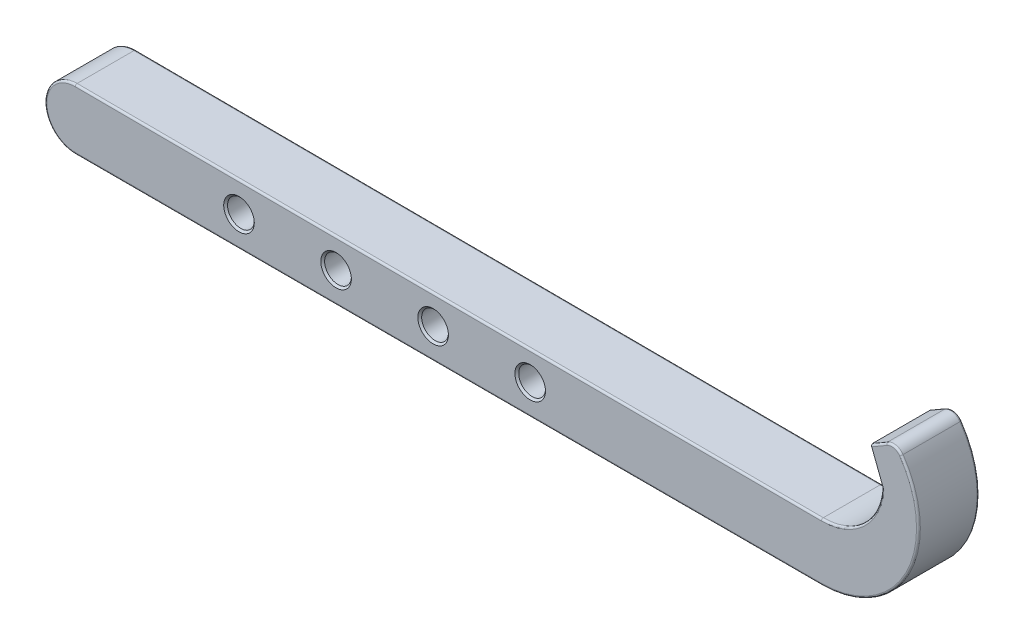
ISO-10303-21;
HEADER;
FILE_DESCRIPTION(('STEP AP214'),'2;1');
FILE_NAME('part.step','',(''),(''),'','','');
FILE_SCHEMA(('AUTOMOTIVE_DESIGN { 1 0 10303 214 1 1 1 1 }'));
ENDSEC;
DATA;
#1=APPLICATION_CONTEXT('core data for automotive mechanical design processes');
#2=APPLICATION_PROTOCOL_DEFINITION('international standard','automotive_design',2000,#1);
#3=PRODUCT_CONTEXT('',#1,'mechanical');
#4=PRODUCT('Part','Part','',(#3));
#5=PRODUCT_RELATED_PRODUCT_CATEGORY('part','',(#4));
#6=PRODUCT_DEFINITION_FORMATION('','',#4);
#7=PRODUCT_DEFINITION_CONTEXT('part definition',#1,'design');
#8=PRODUCT_DEFINITION('design','',#6,#7);
#9=PRODUCT_DEFINITION_SHAPE('','',#8);
#10=(LENGTH_UNIT() NAMED_UNIT(*) SI_UNIT(.MILLI.,.METRE.));
#11=(NAMED_UNIT(*) PLANE_ANGLE_UNIT() SI_UNIT($,.RADIAN.));
#12=(NAMED_UNIT(*) SI_UNIT($,.STERADIAN.) SOLID_ANGLE_UNIT());
#13=UNCERTAINTY_MEASURE_WITH_UNIT(LENGTH_MEASURE(1.E-05),#10,'distance_accuracy_value','');
#14=(GEOMETRIC_REPRESENTATION_CONTEXT(3) GLOBAL_UNCERTAINTY_ASSIGNED_CONTEXT((#13)) GLOBAL_UNIT_ASSIGNED_CONTEXT((#10,
#11,#12)) REPRESENTATION_CONTEXT('',''));
#15=CARTESIAN_POINT('',(0.,0.,0.));
#16=DIRECTION('',(0.,0.,1.));
#17=DIRECTION('',(1.,0.,0.));
#18=AXIS2_PLACEMENT_3D('',#15,#16,#17);
#19=CARTESIAN_POINT('',(-111.669769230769,0.,7.9375));
#20=DIRECTION('',(0.,0.,1.));
#21=DIRECTION('',(1.,0.,0.));
#22=AXIS2_PLACEMENT_3D('',#19,#20,#21);
#23=PLANE('',#22);
#24=DIRECTION('',(0.359521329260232,-0.933136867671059,0.));
#25=VECTOR('',#24,1.);
#26=CARTESIAN_POINT('',(99.4702307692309,23.0323623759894,7.9375));
#27=LINE('',#26,#25);
#28=CARTESIAN_POINT('',(96.7625777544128,30.0600701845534,7.9375));
#29=VERTEX_POINT('',#28);
#30=CARTESIAN_POINT('',(99.9272281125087,21.8462267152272,7.9375));
#31=VERTEX_POINT('',#30);
#32=EDGE_CURVE('E50',#29,#31,#27,.T.);
#33=ORIENTED_EDGE('',*,*,#32,.T.);
#34=CARTESIAN_POINT('',(83.5902307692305,23.0323623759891,7.9375));
#35=DIRECTION('',(0.,0.,1.));
#36=DIRECTION('',(1.,0.,0.));
#37=AXIS2_PLACEMENT_3D('',#34,#35,#36);
#38=CIRCLE('',#37,16.3800000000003);
#39=CARTESIAN_POINT('',(83.5902307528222,6.65235830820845,7.9375));
#40=VERTEX_POINT('',#39);
#41=EDGE_CURVE('E159',#31,#40,#38,.F.);
#42=ORIENTED_EDGE('',*,*,#41,.T.);
#43=DIRECTION('',(-0.999991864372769,0.00403375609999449,0.));
#44=VECTOR('',#43,1.);
#45=CARTESIAN_POINT('',(-111.671786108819,7.44000406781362,7.9375));
#46=LINE('',#45,#44);
#47=CARTESIAN_POINT('',(-111.669769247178,7.43999593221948,7.9375));
#48=VERTEX_POINT('',#47);
#49=EDGE_CURVE('E181',#40,#48,#46,.T.);
#50=ORIENTED_EDGE('',*,*,#49,.T.);
#51=CARTESIAN_POINT('',(-111.669769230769,0.,7.9375));
#52=DIRECTION('',(0.,0.,1.));
#53=DIRECTION('',(1.,0.,0.));
#54=AXIS2_PLACEMENT_3D('',#51,#52,#53);
#55=CIRCLE('',#54,7.44);
#56=CARTESIAN_POINT('',(-111.669769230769,-7.44,7.9375));
#57=VERTEX_POINT('',#56);
#58=EDGE_CURVE('E347',#48,#57,#55,.T.);
#59=ORIENTED_EDGE('',*,*,#58,.T.);
#60=DIRECTION('',(1.,0.,0.));
#61=VECTOR('',#60,1.);
#62=CARTESIAN_POINT('',(83.5902307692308,-7.44,7.9375));
#63=LINE('',#62,#61);
#64=CARTESIAN_POINT('',(83.5902307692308,-7.44,7.9375));
#65=VERTEX_POINT('',#64);
#66=EDGE_CURVE('E349',#57,#65,#63,.T.);
#67=ORIENTED_EDGE('',*,*,#66,.T.);
#68=CARTESIAN_POINT('',(83.5902307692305,17.46,7.9375));
#69=DIRECTION('',(0.,0.,1.));
#70=DIRECTION('',(1.,0.,0.));
#71=AXIS2_PLACEMENT_3D('',#68,#69,#70);
#72=CIRCLE('',#71,24.9000000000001);
#73=CARTESIAN_POINT('',(104.067720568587,31.6262419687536,7.9375));
#74=VERTEX_POINT('',#73);
#75=EDGE_CURVE('E351',#65,#74,#72,.T.);
#76=ORIENTED_EDGE('',*,*,#75,.T.);
#77=CARTESIAN_POINT('',(102.011747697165,30.2039285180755,7.9375));
#78=DIRECTION('',(0.,0.,1.));
#79=DIRECTION('',(1.,0.,0.));
#80=AXIS2_PLACEMENT_3D('',#77,#78,#79);
#81=CIRCLE('',#80,2.50000000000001);
#82=CARTESIAN_POINT('',(100.761747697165,32.3689920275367,7.9375));
#83=VERTEX_POINT('',#82);
#84=EDGE_CURVE('E55',#74,#83,#81,.T.);
#85=ORIENTED_EDGE('',*,*,#84,.T.);
#86=DIRECTION('',(-0.866025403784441,-0.499999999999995,0.));
#87=VECTOR('',#86,1.);
#88=CARTESIAN_POINT('',(96.8306118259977,30.099349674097,7.9375));
#89=LINE('',#88,#87);
#90=EDGE_CURVE('E354',#83,#29,#89,.T.);
#91=ORIENTED_EDGE('',*,*,#90,.T.);
#92=EDGE_LOOP('',(#33,#42,#50,#59,#67,#76,#85,#91));
#93=FACE_BOUND('',#92,.T.);
#94=CARTESIAN_POINT('',(7.39023076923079,0.,7.9375));
#95=DIRECTION('',(0.,0.,1.));
#96=DIRECTION('',(1.,0.,0.));
#97=AXIS2_PLACEMENT_3D('',#94,#95,#96);
#98=CIRCLE('',#97,4.);
#99=CARTESIAN_POINT('',(11.3902307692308,0.,7.9375));
#100=VERTEX_POINT('',#99);
#101=EDGE_CURVE('E178',#100,#100,#98,.F.);
#102=ORIENTED_EDGE('',*,*,#101,.T.);
#103=EDGE_LOOP('',(#102));
#104=FACE_BOUND('',#103,.T.);
#105=CARTESIAN_POINT('',(-18.0097692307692,0.,7.9375));
#106=DIRECTION('',(0.,0.,1.));
#107=DIRECTION('',(1.,0.,0.));
#108=AXIS2_PLACEMENT_3D('',#105,#106,#107);
#109=CIRCLE('',#108,4.);
#110=CARTESIAN_POINT('',(-14.0097692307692,0.,7.9375));
#111=VERTEX_POINT('',#110);
#112=EDGE_CURVE('E293',#111,#111,#109,.F.);
#113=ORIENTED_EDGE('',*,*,#112,.T.);
#114=EDGE_LOOP('',(#113));
#115=FACE_BOUND('',#114,.T.);
#116=CARTESIAN_POINT('',(-43.4097692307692,0.,7.9375));
#117=DIRECTION('',(0.,0.,1.));
#118=DIRECTION('',(1.,0.,0.));
#119=AXIS2_PLACEMENT_3D('',#116,#117,#118);
#120=CIRCLE('',#119,4.00000000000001);
#121=CARTESIAN_POINT('',(-39.4097692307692,0.,7.9375));
#122=VERTEX_POINT('',#121);
#123=EDGE_CURVE('E281',#122,#122,#120,.F.);
#124=ORIENTED_EDGE('',*,*,#123,.T.);
#125=EDGE_LOOP('',(#124));
#126=FACE_BOUND('',#125,.T.);
#127=CARTESIAN_POINT('',(-68.8097692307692,0.,7.9375));
#128=DIRECTION('',(0.,0.,1.));
#129=DIRECTION('',(1.,0.,0.));
#130=AXIS2_PLACEMENT_3D('',#127,#128,#129);
#131=CIRCLE('',#130,4.);
#132=CARTESIAN_POINT('',(-64.8097692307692,0.,7.9375));
#133=VERTEX_POINT('',#132);
#134=EDGE_CURVE('E269',#133,#133,#131,.F.);
#135=ORIENTED_EDGE('',*,*,#134,.T.);
#136=EDGE_LOOP('',(#135));
#137=FACE_BOUND('',#136,.T.);
#138=ADVANCED_FACE('F33',(#93,#104,#115,#126,#137),#23,.T.);
#139=CARTESIAN_POINT('',(-111.669769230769,0.,-7.9375));
#140=DIRECTION('',(0.,0.,1.));
#141=DIRECTION('',(1.,0.,0.));
#142=AXIS2_PLACEMENT_3D('',#139,#140,#141);
#143=PLANE('',#142);
#144=CARTESIAN_POINT('',(7.39023076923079,0.,-7.9375));
#145=DIRECTION('',(0.,0.,1.));
#146=DIRECTION('',(1.,0.,0.));
#147=AXIS2_PLACEMENT_3D('',#144,#145,#146);
#148=CIRCLE('',#147,3.99999999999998);
#149=CARTESIAN_POINT('',(11.3902307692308,0.,-7.9375));
#150=VERTEX_POINT('',#149);
#151=EDGE_CURVE('E296',#150,#150,#148,.T.);
#152=ORIENTED_EDGE('',*,*,#151,.T.);
#153=EDGE_LOOP('',(#152));
#154=FACE_BOUND('',#153,.T.);
#155=CARTESIAN_POINT('',(-18.0097692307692,0.,-7.9375));
#156=DIRECTION('',(0.,0.,1.));
#157=DIRECTION('',(1.,0.,0.));
#158=AXIS2_PLACEMENT_3D('',#155,#156,#157);
#159=CIRCLE('',#158,3.99999999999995);
#160=CARTESIAN_POINT('',(-14.0097692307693,0.,-7.9375));
#161=VERTEX_POINT('',#160);
#162=EDGE_CURVE('E284',#161,#161,#159,.T.);
#163=ORIENTED_EDGE('',*,*,#162,.T.);
#164=EDGE_LOOP('',(#163));
#165=FACE_BOUND('',#164,.T.);
#166=CARTESIAN_POINT('',(-43.4097692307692,0.,-7.9375));
#167=DIRECTION('',(0.,0.,1.));
#168=DIRECTION('',(1.,0.,0.));
#169=AXIS2_PLACEMENT_3D('',#166,#167,#168);
#170=CIRCLE('',#169,3.99999999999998);
#171=CARTESIAN_POINT('',(-39.4097692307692,0.,-7.9375));
#172=VERTEX_POINT('',#171);
#173=EDGE_CURVE('E272',#172,#172,#170,.T.);
#174=ORIENTED_EDGE('',*,*,#173,.T.);
#175=EDGE_LOOP('',(#174));
#176=FACE_BOUND('',#175,.T.);
#177=CARTESIAN_POINT('',(-68.8097692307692,0.,-7.9375));
#178=DIRECTION('',(0.,0.,1.));
#179=DIRECTION('',(1.,0.,0.));
#180=AXIS2_PLACEMENT_3D('',#177,#178,#179);
#181=CIRCLE('',#180,3.99999999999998);
#182=CARTESIAN_POINT('',(-64.8097692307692,0.,-7.9375));
#183=VERTEX_POINT('',#182);
#184=EDGE_CURVE('E260',#183,#183,#181,.T.);
#185=ORIENTED_EDGE('',*,*,#184,.T.);
#186=EDGE_LOOP('',(#185));
#187=FACE_BOUND('',#186,.T.);
#188=CARTESIAN_POINT('',(83.5902307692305,23.0323623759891,-7.9375));
#189=DIRECTION('',(0.,0.,1.));
#190=DIRECTION('',(1.,0.,0.));
#191=AXIS2_PLACEMENT_3D('',#188,#189,#190);
#192=CIRCLE('',#191,16.3800000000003);
#193=CARTESIAN_POINT('',(83.5902307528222,6.65235830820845,-7.9375));
#194=VERTEX_POINT('',#193);
#195=CARTESIAN_POINT('',(99.9272281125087,21.8462267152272,-7.9375));
#196=VERTEX_POINT('',#195);
#197=EDGE_CURVE('E320',#194,#196,#192,.T.);
#198=ORIENTED_EDGE('',*,*,#197,.T.);
#199=DIRECTION('',(0.359521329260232,-0.933136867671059,0.));
#200=VECTOR('',#199,1.);
#201=CARTESIAN_POINT('',(99.4702307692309,23.0323623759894,-7.9375));
#202=LINE('',#201,#200);
#203=CARTESIAN_POINT('',(96.7625777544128,30.0600701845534,-7.9375));
#204=VERTEX_POINT('',#203);
#205=EDGE_CURVE('E232',#204,#196,#202,.T.);
#206=ORIENTED_EDGE('',*,*,#205,.F.);
#207=DIRECTION('',(-0.866025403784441,-0.499999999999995,0.));
#208=VECTOR('',#207,1.);
#209=CARTESIAN_POINT('',(-72.5780746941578,-67.7088010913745,-7.9375));
#210=LINE('',#209,#208);
#211=CARTESIAN_POINT('',(100.761747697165,32.3689920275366,-7.9375));
#212=VERTEX_POINT('',#211);
#213=EDGE_CURVE('E318',#204,#212,#210,.F.);
#214=ORIENTED_EDGE('',*,*,#213,.T.);
#215=CARTESIAN_POINT('',(102.011747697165,30.2039285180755,-7.9375));
#216=DIRECTION('',(0.,0.,1.));
#217=DIRECTION('',(1.,0.,0.));
#218=AXIS2_PLACEMENT_3D('',#215,#216,#217);
#219=CIRCLE('',#218,2.50000000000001);
#220=CARTESIAN_POINT('',(104.067720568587,31.6262419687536,-7.9375));
#221=VERTEX_POINT('',#220);
#222=EDGE_CURVE('E316',#212,#221,#219,.F.);
#223=ORIENTED_EDGE('',*,*,#222,.T.);
#224=CARTESIAN_POINT('',(83.5902307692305,17.46,-7.9375));
#225=DIRECTION('',(0.,0.,1.));
#226=DIRECTION('',(1.,0.,0.));
#227=AXIS2_PLACEMENT_3D('',#224,#225,#226);
#228=CIRCLE('',#227,24.9000000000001);
#229=CARTESIAN_POINT('',(83.5902307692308,-7.44,-7.9375));
#230=VERTEX_POINT('',#229);
#231=EDGE_CURVE('E314',#221,#230,#228,.F.);
#232=ORIENTED_EDGE('',*,*,#231,.T.);
#233=DIRECTION('',(1.,0.,0.));
#234=VECTOR('',#233,1.);
#235=CARTESIAN_POINT('',(-111.669769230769,-7.44,-7.9375));
#236=LINE('',#235,#234);
#237=CARTESIAN_POINT('',(-111.669769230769,-7.44,-7.9375));
#238=VERTEX_POINT('',#237);
#239=EDGE_CURVE('E312',#230,#238,#236,.F.);
#240=ORIENTED_EDGE('',*,*,#239,.T.);
#241=CARTESIAN_POINT('',(-111.669769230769,0.,-7.9375));
#242=DIRECTION('',(0.,0.,1.));
#243=DIRECTION('',(1.,0.,0.));
#244=AXIS2_PLACEMENT_3D('',#241,#242,#243);
#245=CIRCLE('',#244,7.44);
#246=CARTESIAN_POINT('',(-111.669769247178,7.43999593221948,-7.9375));
#247=VERTEX_POINT('',#246);
#248=EDGE_CURVE('E310',#238,#247,#245,.F.);
#249=ORIENTED_EDGE('',*,*,#248,.T.);
#250=DIRECTION('',(-0.999991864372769,0.00403375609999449,0.));
#251=VECTOR('',#250,1.);
#252=CARTESIAN_POINT('',(-111.639758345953,7.43987487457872,-7.9375));
#253=LINE('',#252,#251);
#254=EDGE_CURVE('E308',#247,#194,#253,.F.);
#255=ORIENTED_EDGE('',*,*,#254,.T.);
#256=EDGE_LOOP('',(#198,#206,#214,#223,#232,#240,#249,#255));
#257=FACE_BOUND('',#256,.T.);
#258=ADVANCED_FACE('F415',(#154,#165,#176,#187,#257),#143,.F.);
#259=CARTESIAN_POINT('',(-111.669769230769,0.,7.9375));
#260=DIRECTION('',(0.,0.,-1.));
#261=DIRECTION('',(-1.,0.,0.));
#262=AXIS2_PLACEMENT_3D('',#259,#260,#261);
#263=CYLINDRICAL_SURFACE('',#262,7.94);
#264=DIRECTION('',(0.,0.,-1.));
#265=VECTOR('',#264,1.);
#266=CARTESIAN_POINT('',(-111.669769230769,7.94,7.9375));
#267=LINE('',#266,#265);
#268=CARTESIAN_POINT('',(-111.669769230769,7.94,7.4375));
#269=VERTEX_POINT('',#268);
#270=CARTESIAN_POINT('',(-111.669769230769,7.94,-7.4375));
#271=VERTEX_POINT('',#270);
#272=EDGE_CURVE('E153',#269,#271,#267,.T.);
#273=ORIENTED_EDGE('',*,*,#272,.T.);
#274=CARTESIAN_POINT('',(-111.669769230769,0.,-7.4375));
#275=DIRECTION('',(0.,0.,1.));
#276=DIRECTION('',(1.,0.,0.));
#277=AXIS2_PLACEMENT_3D('',#274,#275,#276);
#278=CIRCLE('',#277,7.94);
#279=CARTESIAN_POINT('',(-111.669769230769,-7.94,-7.4375));
#280=VERTEX_POINT('',#279);
#281=EDGE_CURVE('E344',#271,#280,#278,.T.);
#282=ORIENTED_EDGE('',*,*,#281,.T.);
#283=DIRECTION('',(0.,0.,-1.));
#284=VECTOR('',#283,1.);
#285=CARTESIAN_POINT('',(-111.669769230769,-7.94,7.9375));
#286=LINE('',#285,#284);
#287=CARTESIAN_POINT('',(-111.669769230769,-7.94,7.4375));
#288=VERTEX_POINT('',#287);
#289=EDGE_CURVE('E257',#288,#280,#286,.T.);
#290=ORIENTED_EDGE('',*,*,#289,.F.);
#291=CARTESIAN_POINT('',(-111.669769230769,0.,7.4375));
#292=DIRECTION('',(0.,0.,1.));
#293=DIRECTION('',(1.,0.,0.));
#294=AXIS2_PLACEMENT_3D('',#291,#292,#293);
#295=CIRCLE('',#294,7.94);
#296=EDGE_CURVE('E342',#288,#269,#295,.F.);
#297=ORIENTED_EDGE('',*,*,#296,.T.);
#298=EDGE_LOOP('',(#273,#282,#290,#297));
#299=FACE_BOUND('',#298,.T.);
#300=ADVANCED_FACE('F420',(#299),#263,.T.);
#301=CARTESIAN_POINT('',(-111.669769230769,-7.94,7.9375));
#302=DIRECTION('',(0.,1.,0.));
#303=DIRECTION('',(0.,0.,1.));
#304=AXIS2_PLACEMENT_3D('',#301,#302,#303);
#305=PLANE('',#304);
#306=ORIENTED_EDGE('',*,*,#289,.T.);
#307=DIRECTION('',(1.,0.,0.));
#308=VECTOR('',#307,1.);
#309=CARTESIAN_POINT('',(-111.669769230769,-7.94,-7.4375));
#310=LINE('',#309,#308);
#311=CARTESIAN_POINT('',(83.5902307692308,-7.94000000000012,-7.4375));
#312=VERTEX_POINT('',#311);
#313=EDGE_CURVE('E340',#280,#312,#310,.T.);
#314=ORIENTED_EDGE('',*,*,#313,.T.);
#315=DIRECTION('',(0.,0.,-1.));
#316=VECTOR('',#315,1.);
#317=CARTESIAN_POINT('',(83.5902307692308,-7.94000000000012,7.9375));
#318=LINE('',#317,#316);
#319=CARTESIAN_POINT('',(83.5902307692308,-7.94000000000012,7.4375));
#320=VERTEX_POINT('',#319);
#321=EDGE_CURVE('E254',#320,#312,#318,.T.);
#322=ORIENTED_EDGE('',*,*,#321,.F.);
#323=DIRECTION('',(1.,0.,0.));
#324=VECTOR('',#323,1.);
#325=CARTESIAN_POINT('',(-111.669769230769,-7.94,7.4375));
#326=LINE('',#325,#324);
#327=EDGE_CURVE('E338',#320,#288,#326,.F.);
#328=ORIENTED_EDGE('',*,*,#327,.T.);
#329=EDGE_LOOP('',(#306,#314,#322,#328));
#330=FACE_BOUND('',#329,.T.);
#331=ADVANCED_FACE('F459',(#330),#305,.F.);
#332=CARTESIAN_POINT('',(83.5902307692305,17.46,7.9375));
#333=DIRECTION('',(0.,0.,-1.));
#334=DIRECTION('',(-1.,0.,0.));
#335=AXIS2_PLACEMENT_3D('',#332,#333,#334);
#336=CYLINDRICAL_SURFACE('',#335,25.4000000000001);
#337=ORIENTED_EDGE('',*,*,#321,.T.);
#338=CARTESIAN_POINT('',(83.5902307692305,17.46,-7.4375));
#339=DIRECTION('',(0.,0.,1.));
#340=DIRECTION('',(1.,0.,0.));
#341=AXIS2_PLACEMENT_3D('',#338,#339,#340);
#342=CIRCLE('',#341,25.4000000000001);
#343=CARTESIAN_POINT('',(104.478915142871,31.9107046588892,-7.4375));
#344=VERTEX_POINT('',#343);
#345=EDGE_CURVE('E336',#312,#344,#342,.T.);
#346=ORIENTED_EDGE('',*,*,#345,.T.);
#347=DIRECTION('',(0.,0.,-1.));
#348=VECTOR('',#347,1.);
#349=CARTESIAN_POINT('',(104.478915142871,31.9107046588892,7.9375));
#350=LINE('',#349,#348);
#351=CARTESIAN_POINT('',(104.478915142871,31.9107046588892,7.4375));
#352=VERTEX_POINT('',#351);
#353=EDGE_CURVE('E251',#352,#344,#350,.T.);
#354=ORIENTED_EDGE('',*,*,#353,.F.);
#355=CARTESIAN_POINT('',(83.5902307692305,17.46,7.4375));
#356=DIRECTION('',(0.,0.,1.));
#357=DIRECTION('',(1.,0.,0.));
#358=AXIS2_PLACEMENT_3D('',#355,#356,#357);
#359=CIRCLE('',#358,25.4000000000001);
#360=EDGE_CURVE('E334',#352,#320,#359,.F.);
#361=ORIENTED_EDGE('',*,*,#360,.T.);
#362=EDGE_LOOP('',(#337,#346,#354,#361));
#363=FACE_BOUND('',#362,.T.);
#364=ADVANCED_FACE('F457',(#363),#336,.T.);
#365=CARTESIAN_POINT('',(102.011747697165,30.2039285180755,7.9375));
#366=DIRECTION('',(0.,0.,-1.));
#367=DIRECTION('',(-1.,0.,0.));
#368=AXIS2_PLACEMENT_3D('',#365,#366,#367);
#369=CYLINDRICAL_SURFACE('',#368,3.00000000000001);
#370=ORIENTED_EDGE('',*,*,#353,.T.);
#371=CARTESIAN_POINT('',(102.011747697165,30.2039285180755,-7.4375));
#372=DIRECTION('',(0.,0.,1.));
#373=DIRECTION('',(1.,0.,0.));
#374=AXIS2_PLACEMENT_3D('',#371,#372,#373);
#375=CIRCLE('',#374,3.00000000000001);
#376=CARTESIAN_POINT('',(100.511747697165,32.8020047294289,-7.4375));
#377=VERTEX_POINT('',#376);
#378=EDGE_CURVE('E332',#344,#377,#375,.T.);
#379=ORIENTED_EDGE('',*,*,#378,.T.);
#380=DIRECTION('',(0.,0.,-1.));
#381=VECTOR('',#380,1.);
#382=CARTESIAN_POINT('',(100.511747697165,32.8020047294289,7.9375));
#383=LINE('',#382,#381);
#384=CARTESIAN_POINT('',(100.511747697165,32.8020047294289,7.4375));
#385=VERTEX_POINT('',#384);
#386=EDGE_CURVE('E248',#385,#377,#383,.T.);
#387=ORIENTED_EDGE('',*,*,#386,.F.);
#388=CARTESIAN_POINT('',(102.011747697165,30.2039285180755,7.4375));
#389=DIRECTION('',(0.,0.,1.));
#390=DIRECTION('',(1.,0.,0.));
#391=AXIS2_PLACEMENT_3D('',#388,#389,#390);
#392=CIRCLE('',#391,3.00000000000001);
#393=EDGE_CURVE('E330',#385,#352,#392,.F.);
#394=ORIENTED_EDGE('',*,*,#393,.T.);
#395=EDGE_LOOP('',(#370,#379,#387,#394));
#396=FACE_BOUND('',#395,.T.);
#397=ADVANCED_FACE('F437',(#396),#369,.T.);
#398=CARTESIAN_POINT('',(96.5806118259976,30.5323623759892,7.9375));
#399=DIRECTION('',(0.499999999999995,-0.866025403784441,0.));
#400=DIRECTION('',(0.866025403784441,0.499999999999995,0.));
#401=AXIS2_PLACEMENT_3D('',#398,#399,#400);
#402=PLANE('',#401);
#403=ORIENTED_EDGE('',*,*,#386,.T.);
#404=DIRECTION('',(-0.866025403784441,-0.499999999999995,0.));
#405=VECTOR('',#404,1.);
#406=CARTESIAN_POINT('',(96.5806118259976,30.5323623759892,-7.4375));
#407=LINE('',#406,#405);
#408=CARTESIAN_POINT('',(96.5806118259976,30.5323623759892,-7.4375));
#409=VERTEX_POINT('',#408);
#410=EDGE_CURVE('E324',#377,#409,#407,.T.);
#411=ORIENTED_EDGE('',*,*,#410,.T.);
#412=DIRECTION('',(0.,0.,-1.));
#413=VECTOR('',#412,1.);
#414=CARTESIAN_POINT('',(96.5806118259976,30.5323623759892,7.9375));
#415=LINE('',#414,#413);
#416=CARTESIAN_POINT('',(96.5806118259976,30.5323623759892,7.4375));
#417=VERTEX_POINT('',#416);
#418=EDGE_CURVE('E245',#417,#409,#415,.T.);
#419=ORIENTED_EDGE('',*,*,#418,.F.);
#420=DIRECTION('',(-0.866025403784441,-0.499999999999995,0.));
#421=VECTOR('',#420,1.);
#422=CARTESIAN_POINT('',(100.511747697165,32.8020047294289,7.4375));
#423=LINE('',#422,#421);
#424=EDGE_CURVE('E322',#417,#385,#423,.F.);
#425=ORIENTED_EDGE('',*,*,#424,.T.);
#426=EDGE_LOOP('',(#403,#411,#419,#425));
#427=FACE_BOUND('',#426,.T.);
#428=ADVANCED_FACE('F433',(#427),#402,.F.);
#429=CARTESIAN_POINT('',(99.4702307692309,23.0323623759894,7.9375));
#430=DIRECTION('',(0.933136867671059,0.359521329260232,0.));
#431=DIRECTION('',(-0.359521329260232,0.933136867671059,0.));
#432=AXIS2_PLACEMENT_3D('',#429,#430,#431);
#433=PLANE('',#432);
#434=ORIENTED_EDGE('',*,*,#418,.T.);
#435=CARTESIAN_POINT('',(96.7625777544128,30.0600701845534,-7.4375));
#436=DIRECTION('',(0.933136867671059,0.359521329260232,0.));
#437=DIRECTION('',(0.359521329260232,-0.933136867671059,0.));
#438=AXIS2_PLACEMENT_3D('',#435,#436,#437);
#439=ELLIPSE('',#438,0.506133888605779,0.5);
#440=EDGE_CURVE('E328',#409,#204,#439,.F.);
#441=ORIENTED_EDGE('',*,*,#440,.T.);
#442=ORIENTED_EDGE('',*,*,#205,.T.);
#443=CARTESIAN_POINT('',(99.9272281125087,21.8462267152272,-7.9375));
#444=CARTESIAN_POINT('',(99.913140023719,21.8827923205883,-7.93749370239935));
#445=CARTESIAN_POINT('',(99.8990526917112,21.9193559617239,-7.93666341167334));
#446=CARTESIAN_POINT('',(99.8709003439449,21.9924253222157,-7.93337699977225));
#447=CARTESIAN_POINT('',(99.8568353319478,22.0289310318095,-7.9309206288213));
#448=CARTESIAN_POINT('',(99.8286299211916,22.1021381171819,-7.92437572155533));
#449=CARTESIAN_POINT('',(99.8144899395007,22.1388384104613,-7.92027309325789));
#450=CARTESIAN_POINT('',(99.7862884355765,22.2120353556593,-7.91040466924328));
#451=CARTESIAN_POINT('',(99.7722269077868,22.2485320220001,-7.90463899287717));
#452=CARTESIAN_POINT('',(99.7302434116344,22.3575000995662,-7.88479019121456));
#453=CARTESIAN_POINT('',(99.7024635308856,22.4296027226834,-7.86814204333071));
#454=CARTESIAN_POINT('',(99.6614523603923,22.5360471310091,-7.83703491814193));
#455=CARTESIAN_POINT('',(99.6479128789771,22.5711888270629,-7.82566645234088));
#456=CARTESIAN_POINT('',(99.6211284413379,22.6407077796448,-7.80052070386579));
#457=CARTESIAN_POINT('',(99.6078832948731,22.6750855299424,-7.7867450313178));
#458=CARTESIAN_POINT('',(99.5859528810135,22.7320058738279,-7.76103294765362));
#459=CARTESIAN_POINT('',(99.5771479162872,22.7548591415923,-7.74988842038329));
#460=CARTESIAN_POINT('',(99.5597877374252,22.7999174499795,-7.72583440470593));
#461=CARTESIAN_POINT('',(99.551234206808,22.822118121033,-7.71291534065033));
#462=CARTESIAN_POINT('',(99.5325589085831,22.8705898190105,-7.68155320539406));
#463=CARTESIAN_POINT('',(99.5225615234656,22.8965380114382,-7.66253077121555));
#464=CARTESIAN_POINT('',(99.5039023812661,22.9449677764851,-7.61994650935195));
#465=CARTESIAN_POINT('',(99.4952299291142,22.9674771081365,-7.59642491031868));
#466=CARTESIAN_POINT('',(99.4852729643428,22.9933203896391,-7.55983401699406));
#467=CARTESIAN_POINT('',(99.4827552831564,22.9998550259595,-7.54940156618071));
#468=CARTESIAN_POINT('',(99.4782899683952,23.0114447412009,-7.52766696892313));
#469=CARTESIAN_POINT('',(99.4763399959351,23.0165058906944,-7.51636864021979));
#470=CARTESIAN_POINT('',(99.4733200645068,23.0243441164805,-7.49402574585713));
#471=CARTESIAN_POINT('',(99.4721869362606,23.0272851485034,-7.48304906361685));
#472=CARTESIAN_POINT('',(99.4706308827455,23.0313238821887,-7.46056800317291));
#473=CARTESIAN_POINT('',(99.4702176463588,23.032396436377,-7.44905853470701));
#474=CARTESIAN_POINT('',(99.4702307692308,23.0323623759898,-7.43750000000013));
#475=B_SPLINE_CURVE_WITH_KNOTS('',3,(#443,#444,#445,#446,#447,#448,#449,#450,#451,#452,#453,
#454,#455,#456,#457,#458,#459,#460,#461,#462,#463,#464,#465,#466,#467,#468,#469,#470,#471,#472,
#473,#474),.UNSPECIFIED.,.F.,.F.,(4,2,2,2,2,2,2,2,2,2,2,2,2,2,2,4),(0.,0.117544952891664,
0.235107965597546,0.353699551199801,0.472282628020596,0.708956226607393,0.826916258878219,
0.944797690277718,1.02547141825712,1.10659895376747,1.20745259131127,1.3074433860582,
1.34503815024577,1.38247576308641,1.41656074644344,1.45110102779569),.UNSPECIFIED.);
#476=CARTESIAN_POINT('',(99.4702307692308,23.0323623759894,-7.4375));
#477=VERTEX_POINT('',#476);
#478=EDGE_CURVE('E42',#196,#477,#475,.T.);
#479=ORIENTED_EDGE('',*,*,#478,.T.);
#480=DIRECTION('',(0.,0.,-1.));
#481=VECTOR('',#480,1.);
#482=CARTESIAN_POINT('',(99.4702307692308,23.0323623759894,7.9375));
#483=LINE('',#482,#481);
#484=CARTESIAN_POINT('',(99.4702307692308,23.0323623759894,7.4375));
#485=VERTEX_POINT('',#484);
#486=EDGE_CURVE('E170',#485,#477,#483,.T.);
#487=ORIENTED_EDGE('',*,*,#486,.F.);
#488=CARTESIAN_POINT('',(99.4702307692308,23.0323623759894,7.4375));
#489=CARTESIAN_POINT('',(99.4702180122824,23.0323954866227,7.44902944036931));
#490=CARTESIAN_POINT('',(99.470628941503,23.0313289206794,7.46050905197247));
#491=CARTESIAN_POINT('',(99.4721768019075,23.0273114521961,7.48293211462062));
#492=CARTESIAN_POINT('',(99.4733039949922,23.0243858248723,7.49388066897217));
#493=CARTESIAN_POINT('',(99.4765415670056,23.0159827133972,7.51789290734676));
#494=CARTESIAN_POINT('',(99.4788315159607,23.010039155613,7.53076513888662));
#495=CARTESIAN_POINT('',(99.4841214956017,22.996309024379,7.55537911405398));
#496=CARTESIAN_POINT('',(99.4871254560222,22.9885122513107,7.56711407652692));
#497=CARTESIAN_POINT('',(99.4959502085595,22.9656076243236,7.59745581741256));
#498=CARTESIAN_POINT('',(99.50224879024,22.9492596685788,7.61497308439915));
#499=CARTESIAN_POINT('',(99.5156486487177,22.9144803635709,7.64738411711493));
#500=CARTESIAN_POINT('',(99.522751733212,22.8960443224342,7.66227177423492));
#501=CARTESIAN_POINT('',(99.5400728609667,22.8510873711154,7.69497139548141));
#502=CARTESIAN_POINT('',(99.5504972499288,22.8240308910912,7.71192829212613));
#503=CARTESIAN_POINT('',(99.5718720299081,22.7685526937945,7.74309058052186));
#504=CARTESIAN_POINT('',(99.5828233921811,22.74012845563,7.75729062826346));
#505=CARTESIAN_POINT('',(99.6051480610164,22.6821848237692,7.78360611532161));
#506=CARTESIAN_POINT('',(99.6165240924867,22.6526583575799,7.79570349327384));
#507=CARTESIAN_POINT('',(99.6394960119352,22.593034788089,7.81804028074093));
#508=CARTESIAN_POINT('',(99.6510917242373,22.5629381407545,7.8282811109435));
#509=CARTESIAN_POINT('',(99.6846043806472,22.4759561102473,7.855394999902));
#510=CARTESIAN_POINT('',(99.7067289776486,22.4185317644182,7.8702924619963));
#511=CARTESIAN_POINT('',(99.7513305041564,22.302768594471,7.89547628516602));
#512=CARTESIAN_POINT('',(99.7738078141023,22.2444287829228,7.90575725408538));
#513=CARTESIAN_POINT('',(99.8180949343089,22.1294816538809,7.9217599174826));
#514=CARTESIAN_POINT('',(99.8398973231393,22.0728935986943,7.92764120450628));
#515=CARTESIAN_POINT('',(99.8835427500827,21.959611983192,7.93548727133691));
#516=CARTESIAN_POINT('',(99.9053855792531,21.9029189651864,7.93746103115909));
#517=CARTESIAN_POINT('',(99.9272281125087,21.8462267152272,7.9375));
#518=B_SPLINE_CURVE_WITH_KNOTS('',3,(#488,#489,#490,#491,#492,#493,#494,#495,#496,#497,#498,
#499,#500,#501,#502,#503,#504,#505,#506,#507,#508,#509,#510,#511,#512,#513,#514,#515,#516,#517),
.UNSPECIFIED.,.F.,.F.,(4,2,2,2,2,2,2,2,2,2,2,2,2,2,4),(0.,0.034451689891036,0.0684447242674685,
0.111287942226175,0.154372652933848,0.228278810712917,0.302354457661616,0.40289075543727,
0.503620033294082,0.605175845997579,0.706653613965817,0.896365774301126,1.08629894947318,
1.26895499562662,1.45119078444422),.UNSPECIFIED.);
#519=EDGE_CURVE('E11',#485,#31,#518,.T.);
#520=ORIENTED_EDGE('',*,*,#519,.T.);
#521=ORIENTED_EDGE('',*,*,#32,.F.);
#522=CARTESIAN_POINT('',(96.7625777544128,30.0600701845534,7.4375));
#523=DIRECTION('',(0.933136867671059,0.359521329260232,0.));
#524=DIRECTION('',(-0.359521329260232,0.933136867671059,0.));
#525=AXIS2_PLACEMENT_3D('',#522,#523,#524);
#526=ELLIPSE('',#525,0.506133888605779,0.5);
#527=EDGE_CURVE('E326',#29,#417,#526,.F.);
#528=ORIENTED_EDGE('',*,*,#527,.T.);
#529=EDGE_LOOP('',(#434,#441,#442,#479,#487,#520,#521,#528));
#530=FACE_BOUND('',#529,.T.);
#531=ADVANCED_FACE('F361',(#530),#433,.F.);
#532=CARTESIAN_POINT('',(83.5902307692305,23.0323623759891,7.9375));
#533=DIRECTION('',(0.,0.,-1.));
#534=DIRECTION('',(-1.,0.,0.));
#535=AXIS2_PLACEMENT_3D('',#532,#533,#534);
#536=CYLINDRICAL_SURFACE('',#535,15.8800000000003);
#537=ORIENTED_EDGE('',*,*,#486,.T.);
#538=CARTESIAN_POINT('',(83.5902307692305,23.0323623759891,-7.4375));
#539=DIRECTION('',(0.,0.,1.));
#540=DIRECTION('',(1.,0.,0.));
#541=AXIS2_PLACEMENT_3D('',#538,#539,#540);
#542=CIRCLE('',#541,15.8800000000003);
#543=CARTESIAN_POINT('',(83.5902307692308,7.15236237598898,-7.4375));
#544=VERTEX_POINT('',#543);
#545=EDGE_CURVE('E169',#477,#544,#542,.F.);
#546=ORIENTED_EDGE('',*,*,#545,.T.);
#547=DIRECTION('',(0.,0.,-1.));
#548=VECTOR('',#547,1.);
#549=CARTESIAN_POINT('',(83.5902307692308,7.15236237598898,7.9375));
#550=LINE('',#549,#548);
#551=CARTESIAN_POINT('',(83.5902307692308,7.15236237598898,7.4375));
#552=VERTEX_POINT('',#551);
#553=EDGE_CURVE('E151',#552,#544,#550,.T.);
#554=ORIENTED_EDGE('',*,*,#553,.F.);
#555=CARTESIAN_POINT('',(83.5902307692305,23.0323623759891,7.4375));
#556=DIRECTION('',(0.,0.,1.));
#557=DIRECTION('',(1.,0.,0.));
#558=AXIS2_PLACEMENT_3D('',#555,#556,#557);
#559=CIRCLE('',#558,15.8800000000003);
#560=EDGE_CURVE('E166',#552,#485,#559,.T.);
#561=ORIENTED_EDGE('',*,*,#560,.T.);
#562=EDGE_LOOP('',(#537,#546,#554,#561));
#563=FACE_BOUND('',#562,.T.);
#564=ADVANCED_FACE('F165',(#563),#536,.F.);
#565=CARTESIAN_POINT('',(-111.669769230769,7.94,7.9375));
#566=DIRECTION('',(-0.00403375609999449,-0.999991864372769,0.));
#567=DIRECTION('',(0.999991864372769,-0.00403375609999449,0.));
#568=AXIS2_PLACEMENT_3D('',#565,#566,#567);
#569=PLANE('',#568);
#570=ORIENTED_EDGE('',*,*,#553,.T.);
#571=DIRECTION('',(-0.999991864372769,0.00403375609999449,0.));
#572=VECTOR('',#571,1.);
#573=CARTESIAN_POINT('',(-111.669769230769,7.94,-7.4375));
#574=LINE('',#573,#572);
#575=EDGE_CURVE('E158',#544,#271,#574,.T.);
#576=ORIENTED_EDGE('',*,*,#575,.T.);
#577=ORIENTED_EDGE('',*,*,#272,.F.);
#578=DIRECTION('',(-0.999991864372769,0.00403375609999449,0.));
#579=VECTOR('',#578,1.);
#580=CARTESIAN_POINT('',(83.5902307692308,7.15236237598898,7.4375));
#581=LINE('',#580,#579);
#582=EDGE_CURVE('E148',#269,#552,#581,.F.);
#583=ORIENTED_EDGE('',*,*,#582,.T.);
#584=EDGE_LOOP('',(#570,#576,#577,#583));
#585=FACE_BOUND('',#584,.T.);
#586=ADVANCED_FACE('F150',(#585),#569,.F.);
#587=CARTESIAN_POINT('',(-68.8097692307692,0.,7.9375));
#588=DIRECTION('',(0.,0.,-1.));
#589=DIRECTION('',(-1.,0.,0.));
#590=AXIS2_PLACEMENT_3D('',#587,#588,#589);
#591=CYLINDRICAL_SURFACE('',#590,3.50000000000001);
#592=CARTESIAN_POINT('',(-68.8097692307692,0.,-7.43750000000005));
#593=DIRECTION('',(0.,0.,1.));
#594=DIRECTION('',(1.,0.,0.));
#595=AXIS2_PLACEMENT_3D('',#592,#593,#594);
#596=CIRCLE('',#595,3.50000000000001);
#597=CARTESIAN_POINT('',(-65.3097692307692,0.,-7.43750000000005));
#598=VERTEX_POINT('',#597);
#599=EDGE_CURVE('E266',#598,#598,#596,.F.);
#600=ORIENTED_EDGE('',*,*,#599,.T.);
#601=EDGE_LOOP('',(#600));
#602=FACE_BOUND('',#601,.T.);
#603=CARTESIAN_POINT('',(-68.8097692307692,0.,7.43749999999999));
#604=DIRECTION('',(0.,0.,1.));
#605=DIRECTION('',(1.,0.,0.));
#606=AXIS2_PLACEMENT_3D('',#603,#604,#605);
#607=CIRCLE('',#606,3.50000000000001);
#608=CARTESIAN_POINT('',(-65.3097692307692,0.,7.43749999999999));
#609=VERTEX_POINT('',#608);
#610=EDGE_CURVE('E263',#609,#609,#607,.T.);
#611=ORIENTED_EDGE('',*,*,#610,.T.);
#612=EDGE_LOOP('',(#611));
#613=FACE_BOUND('',#612,.T.);
#614=ADVANCED_FACE('F425',(#602,#613),#591,.F.);
#615=CARTESIAN_POINT('',(-43.4097692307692,0.,7.9375));
#616=DIRECTION('',(0.,0.,-1.));
#617=DIRECTION('',(-1.,0.,0.));
#618=AXIS2_PLACEMENT_3D('',#615,#616,#617);
#619=CYLINDRICAL_SURFACE('',#618,3.50000000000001);
#620=CARTESIAN_POINT('',(-43.4097692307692,0.,-7.43750000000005));
#621=DIRECTION('',(0.,0.,1.));
#622=DIRECTION('',(1.,0.,0.));
#623=AXIS2_PLACEMENT_3D('',#620,#621,#622);
#624=CIRCLE('',#623,3.50000000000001);
#625=CARTESIAN_POINT('',(-39.9097692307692,0.,-7.43750000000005));
#626=VERTEX_POINT('',#625);
#627=EDGE_CURVE('E278',#626,#626,#624,.F.);
#628=ORIENTED_EDGE('',*,*,#627,.T.);
#629=EDGE_LOOP('',(#628));
#630=FACE_BOUND('',#629,.T.);
#631=CARTESIAN_POINT('',(-43.4097692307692,0.,7.43749999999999));
#632=DIRECTION('',(0.,0.,1.));
#633=DIRECTION('',(1.,0.,0.));
#634=AXIS2_PLACEMENT_3D('',#631,#632,#633);
#635=CIRCLE('',#634,3.50000000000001);
#636=CARTESIAN_POINT('',(-39.9097692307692,0.,7.43749999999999));
#637=VERTEX_POINT('',#636);
#638=EDGE_CURVE('E275',#637,#637,#635,.T.);
#639=ORIENTED_EDGE('',*,*,#638,.T.);
#640=EDGE_LOOP('',(#639));
#641=FACE_BOUND('',#640,.T.);
#642=ADVANCED_FACE('F535',(#630,#641),#619,.F.);
#643=CARTESIAN_POINT('',(-18.0097692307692,0.,7.9375));
#644=DIRECTION('',(0.,0.,-1.));
#645=DIRECTION('',(-1.,0.,0.));
#646=AXIS2_PLACEMENT_3D('',#643,#644,#645);
#647=CYLINDRICAL_SURFACE('',#646,3.50000000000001);
#648=CARTESIAN_POINT('',(-18.0097692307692,0.,-7.43750000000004));
#649=DIRECTION('',(0.,0.,1.));
#650=DIRECTION('',(1.,0.,0.));
#651=AXIS2_PLACEMENT_3D('',#648,#649,#650);
#652=CIRCLE('',#651,3.50000000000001);
#653=CARTESIAN_POINT('',(-14.5097692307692,0.,-7.43750000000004));
#654=VERTEX_POINT('',#653);
#655=EDGE_CURVE('E290',#654,#654,#652,.F.);
#656=ORIENTED_EDGE('',*,*,#655,.T.);
#657=EDGE_LOOP('',(#656));
#658=FACE_BOUND('',#657,.T.);
#659=CARTESIAN_POINT('',(-18.0097692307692,0.,7.43749999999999));
#660=DIRECTION('',(0.,0.,1.));
#661=DIRECTION('',(1.,0.,0.));
#662=AXIS2_PLACEMENT_3D('',#659,#660,#661);
#663=CIRCLE('',#662,3.50000000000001);
#664=CARTESIAN_POINT('',(-14.5097692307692,0.,7.43749999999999));
#665=VERTEX_POINT('',#664);
#666=EDGE_CURVE('E287',#665,#665,#663,.T.);
#667=ORIENTED_EDGE('',*,*,#666,.T.);
#668=EDGE_LOOP('',(#667));
#669=FACE_BOUND('',#668,.T.);
#670=ADVANCED_FACE('F528',(#658,#669),#647,.F.);
#671=CARTESIAN_POINT('',(7.39023076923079,0.,7.9375));
#672=DIRECTION('',(0.,0.,-1.));
#673=DIRECTION('',(-1.,0.,0.));
#674=AXIS2_PLACEMENT_3D('',#671,#672,#673);
#675=CYLINDRICAL_SURFACE('',#674,3.50000000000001);
#676=CARTESIAN_POINT('',(7.39023076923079,0.,-7.43750000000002));
#677=DIRECTION('',(0.,0.,1.));
#678=DIRECTION('',(1.,0.,0.));
#679=AXIS2_PLACEMENT_3D('',#676,#677,#678);
#680=CIRCLE('',#679,3.50000000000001);
#681=CARTESIAN_POINT('',(10.8902307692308,0.,-7.43750000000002));
#682=VERTEX_POINT('',#681);
#683=EDGE_CURVE('E302',#682,#682,#680,.F.);
#684=ORIENTED_EDGE('',*,*,#683,.T.);
#685=EDGE_LOOP('',(#684));
#686=FACE_BOUND('',#685,.T.);
#687=CARTESIAN_POINT('',(7.39023076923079,0.,7.43749999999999));
#688=DIRECTION('',(0.,0.,1.));
#689=DIRECTION('',(1.,0.,0.));
#690=AXIS2_PLACEMENT_3D('',#687,#688,#689);
#691=CIRCLE('',#690,3.50000000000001);
#692=CARTESIAN_POINT('',(10.8902307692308,0.,7.43749999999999));
#693=VERTEX_POINT('',#692);
#694=EDGE_CURVE('E299',#693,#693,#691,.T.);
#695=ORIENTED_EDGE('',*,*,#694,.T.);
#696=EDGE_LOOP('',(#695));
#697=FACE_BOUND('',#696,.T.);
#698=ADVANCED_FACE('F486',(#686,#697),#675,.F.);
#699=CARTESIAN_POINT('',(-68.8097692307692,0.,-7.9375));
#700=DIRECTION('',(0.,0.,-1.));
#701=DIRECTION('',(-1.,0.,0.));
#702=AXIS2_PLACEMENT_3D('',#699,#700,#701);
#703=CONICAL_SURFACE('',#702,3.99999999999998,0.785398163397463);
#704=ORIENTED_EDGE('',*,*,#599,.F.);
#705=EDGE_LOOP('',(#704));
#706=FACE_BOUND('',#705,.T.);
#707=ORIENTED_EDGE('',*,*,#184,.F.);
#708=EDGE_LOOP('',(#707));
#709=FACE_BOUND('',#708,.T.);
#710=ADVANCED_FACE('F482',(#706,#709),#703,.F.);
#711=CARTESIAN_POINT('',(-68.8097692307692,0.,7.43749999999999));
#712=DIRECTION('',(0.,0.,1.));
#713=DIRECTION('',(1.,0.,0.));
#714=AXIS2_PLACEMENT_3D('',#711,#712,#713);
#715=CONICAL_SURFACE('',#714,3.50000000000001,0.785398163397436);
#716=ORIENTED_EDGE('',*,*,#134,.F.);
#717=EDGE_LOOP('',(#716));
#718=FACE_BOUND('',#717,.T.);
#719=ORIENTED_EDGE('',*,*,#610,.F.);
#720=EDGE_LOOP('',(#719));
#721=FACE_BOUND('',#720,.T.);
#722=ADVANCED_FACE('F485',(#718,#721),#715,.F.);
#723=CARTESIAN_POINT('',(-43.4097692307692,0.,-7.9375));
#724=DIRECTION('',(0.,0.,-1.));
#725=DIRECTION('',(-1.,0.,0.));
#726=AXIS2_PLACEMENT_3D('',#723,#724,#725);
#727=CONICAL_SURFACE('',#726,3.99999999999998,0.78539816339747);
#728=ORIENTED_EDGE('',*,*,#627,.F.);
#729=EDGE_LOOP('',(#728));
#730=FACE_BOUND('',#729,.T.);
#731=ORIENTED_EDGE('',*,*,#173,.F.);
#732=EDGE_LOOP('',(#731));
#733=FACE_BOUND('',#732,.T.);
#734=ADVANCED_FACE('F490',(#730,#733),#727,.F.);
#735=CARTESIAN_POINT('',(-43.4097692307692,0.,7.43749999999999));
#736=DIRECTION('',(0.,0.,1.));
#737=DIRECTION('',(1.,0.,0.));
#738=AXIS2_PLACEMENT_3D('',#735,#736,#737);
#739=CONICAL_SURFACE('',#738,3.50000000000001,0.785398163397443);
#740=ORIENTED_EDGE('',*,*,#123,.F.);
#741=EDGE_LOOP('',(#740));
#742=FACE_BOUND('',#741,.T.);
#743=ORIENTED_EDGE('',*,*,#638,.F.);
#744=EDGE_LOOP('',(#743));
#745=FACE_BOUND('',#744,.T.);
#746=ADVANCED_FACE('F494',(#742,#745),#739,.F.);
#747=CARTESIAN_POINT('',(-18.0097692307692,0.,-7.9375));
#748=DIRECTION('',(0.,0.,-1.));
#749=DIRECTION('',(-1.,0.,0.));
#750=AXIS2_PLACEMENT_3D('',#747,#748,#749);
#751=CONICAL_SURFACE('',#750,3.99999999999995,0.785398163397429);
#752=ORIENTED_EDGE('',*,*,#655,.F.);
#753=EDGE_LOOP('',(#752));
#754=FACE_BOUND('',#753,.T.);
#755=ORIENTED_EDGE('',*,*,#162,.F.);
#756=EDGE_LOOP('',(#755));
#757=FACE_BOUND('',#756,.T.);
#758=ADVANCED_FACE('F498',(#754,#757),#751,.F.);
#759=CARTESIAN_POINT('',(-18.0097692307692,0.,7.43749999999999));
#760=DIRECTION('',(0.,0.,1.));
#761=DIRECTION('',(1.,0.,0.));
#762=AXIS2_PLACEMENT_3D('',#759,#760,#761);
#763=CONICAL_SURFACE('',#762,3.50000000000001,0.785398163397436);
#764=ORIENTED_EDGE('',*,*,#112,.F.);
#765=EDGE_LOOP('',(#764));
#766=FACE_BOUND('',#765,.T.);
#767=ORIENTED_EDGE('',*,*,#666,.F.);
#768=EDGE_LOOP('',(#767));
#769=FACE_BOUND('',#768,.T.);
#770=ADVANCED_FACE('F502',(#766,#769),#763,.F.);
#771=CARTESIAN_POINT('',(7.39023076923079,0.,-7.9375));
#772=DIRECTION('',(0.,0.,-1.));
#773=DIRECTION('',(-1.,0.,0.));
#774=AXIS2_PLACEMENT_3D('',#771,#772,#773);
#775=CONICAL_SURFACE('',#774,3.99999999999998,0.785398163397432);
#776=ORIENTED_EDGE('',*,*,#683,.F.);
#777=EDGE_LOOP('',(#776));
#778=FACE_BOUND('',#777,.T.);
#779=ORIENTED_EDGE('',*,*,#151,.F.);
#780=EDGE_LOOP('',(#779));
#781=FACE_BOUND('',#780,.T.);
#782=ADVANCED_FACE('F505',(#778,#781),#775,.F.);
#783=CARTESIAN_POINT('',(7.39023076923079,0.,7.43749999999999));
#784=DIRECTION('',(0.,0.,1.));
#785=DIRECTION('',(1.,0.,0.));
#786=AXIS2_PLACEMENT_3D('',#783,#784,#785);
#787=CONICAL_SURFACE('',#786,3.50000000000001,0.785398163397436);
#788=ORIENTED_EDGE('',*,*,#101,.F.);
#789=EDGE_LOOP('',(#788));
#790=FACE_BOUND('',#789,.T.);
#791=ORIENTED_EDGE('',*,*,#694,.F.);
#792=EDGE_LOOP('',(#791));
#793=FACE_BOUND('',#792,.T.);
#794=ADVANCED_FACE('F371',(#790,#793),#787,.F.);
#795=CARTESIAN_POINT('',(96.8306118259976,30.099349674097,-7.4375));
#796=DIRECTION('',(-0.866025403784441,-0.499999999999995,0.));
#797=DIRECTION('',(0.499999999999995,-0.866025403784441,0.));
#798=AXIS2_PLACEMENT_3D('',#795,#796,#797);
#799=CYLINDRICAL_SURFACE('',#798,0.5);
#800=ORIENTED_EDGE('',*,*,#440,.F.);
#801=ORIENTED_EDGE('',*,*,#410,.F.);
#802=CARTESIAN_POINT('',(100.761747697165,32.3689920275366,-7.4375));
#803=DIRECTION('',(0.866025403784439,0.499999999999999,0.));
#804=DIRECTION('',(-0.499999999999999,0.86602540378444,0.));
#805=AXIS2_PLACEMENT_3D('',#802,#803,#804);
#806=CIRCLE('',#805,0.5);
#807=EDGE_CURVE('E187',#212,#377,#806,.T.);
#808=ORIENTED_EDGE('',*,*,#807,.F.);
#809=ORIENTED_EDGE('',*,*,#213,.F.);
#810=EDGE_LOOP('',(#800,#801,#808,#809));
#811=FACE_BOUND('',#810,.T.);
#812=ADVANCED_FACE('F390',(#811),#799,.T.);
#813=CARTESIAN_POINT('',(102.011747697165,30.2039285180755,-7.4375));
#814=DIRECTION('',(0.,0.,1.));
#815=DIRECTION('',(1.,0.,0.));
#816=AXIS2_PLACEMENT_3D('',#813,#814,#815);
#817=TOROIDAL_SURFACE('',#816,2.50000000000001,0.5);
#818=ORIENTED_EDGE('',*,*,#807,.T.);
#819=ORIENTED_EDGE('',*,*,#378,.F.);
#820=CARTESIAN_POINT('',(104.067720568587,31.6262419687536,-7.4375));
#821=DIRECTION('',(0.568925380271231,-0.822389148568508,0.));
#822=DIRECTION('',(0.822389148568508,0.568925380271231,0.));
#823=AXIS2_PLACEMENT_3D('',#820,#821,#822);
#824=CIRCLE('',#823,0.5);
#825=EDGE_CURVE('E225',#221,#344,#824,.T.);
#826=ORIENTED_EDGE('',*,*,#825,.F.);
#827=ORIENTED_EDGE('',*,*,#222,.F.);
#828=EDGE_LOOP('',(#818,#819,#826,#827));
#829=FACE_BOUND('',#828,.T.);
#830=ADVANCED_FACE('F387',(#829),#817,.T.);
#831=CARTESIAN_POINT('',(83.5902307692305,17.46,-7.4375));
#832=DIRECTION('',(0.,0.,1.));
#833=DIRECTION('',(1.,0.,0.));
#834=AXIS2_PLACEMENT_3D('',#831,#832,#833);
#835=TOROIDAL_SURFACE('',#834,24.9000000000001,0.5);
#836=ORIENTED_EDGE('',*,*,#825,.T.);
#837=ORIENTED_EDGE('',*,*,#345,.F.);
#838=CARTESIAN_POINT('',(83.5902307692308,-7.44000000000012,-7.4375));
#839=DIRECTION('',(-1.,0.,0.));
#840=DIRECTION('',(0.,0.,1.));
#841=AXIS2_PLACEMENT_3D('',#838,#839,#840);
#842=CIRCLE('',#841,0.5);
#843=EDGE_CURVE('E223',#230,#312,#842,.T.);
#844=ORIENTED_EDGE('',*,*,#843,.F.);
#845=ORIENTED_EDGE('',*,*,#231,.F.);
#846=EDGE_LOOP('',(#836,#837,#844,#845));
#847=FACE_BOUND('',#846,.T.);
#848=ADVANCED_FACE('F383',(#847),#835,.T.);
#849=CARTESIAN_POINT('',(-111.669769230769,-7.44,-7.4375));
#850=DIRECTION('',(1.,0.,0.));
#851=DIRECTION('',(0.,0.,-1.));
#852=AXIS2_PLACEMENT_3D('',#849,#850,#851);
#853=CYLINDRICAL_SURFACE('',#852,0.5);
#854=ORIENTED_EDGE('',*,*,#843,.T.);
#855=ORIENTED_EDGE('',*,*,#313,.F.);
#856=CARTESIAN_POINT('',(-111.669769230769,-7.44,-7.4375));
#857=DIRECTION('',(-1.,0.,0.));
#858=DIRECTION('',(0.,0.,1.));
#859=AXIS2_PLACEMENT_3D('',#856,#857,#858);
#860=CIRCLE('',#859,0.5);
#861=EDGE_CURVE('E212',#238,#280,#860,.T.);
#862=ORIENTED_EDGE('',*,*,#861,.F.);
#863=ORIENTED_EDGE('',*,*,#239,.F.);
#864=EDGE_LOOP('',(#854,#855,#862,#863));
#865=FACE_BOUND('',#864,.T.);
#866=ADVANCED_FACE('F379',(#865),#853,.T.);
#867=CARTESIAN_POINT('',(-111.669769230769,0.,-7.4375));
#868=DIRECTION('',(0.,0.,1.));
#869=DIRECTION('',(1.,0.,0.));
#870=AXIS2_PLACEMENT_3D('',#867,#868,#869);
#871=TOROIDAL_SURFACE('',#870,7.44,0.5);
#872=ORIENTED_EDGE('',*,*,#861,.T.);
#873=ORIENTED_EDGE('',*,*,#281,.F.);
#874=CARTESIAN_POINT('',(-111.669769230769,7.44,-7.4375));
#875=DIRECTION('',(1.,0.,0.));
#876=DIRECTION('',(0.,0.,-1.));
#877=AXIS2_PLACEMENT_3D('',#874,#875,#876);
#878=CIRCLE('',#877,0.5);
#879=EDGE_CURVE('E205',#247,#271,#878,.T.);
#880=ORIENTED_EDGE('',*,*,#879,.F.);
#881=ORIENTED_EDGE('',*,*,#248,.F.);
#882=EDGE_LOOP('',(#872,#873,#880,#881));
#883=FACE_BOUND('',#882,.T.);
#884=ADVANCED_FACE('F375',(#883),#871,.T.);
#885=CARTESIAN_POINT('',(-111.671786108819,7.44000406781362,-7.4375));
#886=DIRECTION('',(-0.999991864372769,0.00403375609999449,0.));
#887=DIRECTION('',(-0.00403375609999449,-0.999991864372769,0.));
#888=AXIS2_PLACEMENT_3D('',#885,#886,#887);
#889=CYLINDRICAL_SURFACE('',#888,0.5);
#890=ORIENTED_EDGE('',*,*,#879,.T.);
#891=ORIENTED_EDGE('',*,*,#575,.F.);
#892=CARTESIAN_POINT('',(83.5902307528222,6.65235830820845,-7.4375));
#893=DIRECTION('',(1.,-3.28168431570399E-08,0.));
#894=DIRECTION('',(3.28168431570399E-08,1.,0.));
#895=AXIS2_PLACEMENT_3D('',#892,#893,#894);
#896=CIRCLE('',#895,0.5);
#897=EDGE_CURVE('E201',#194,#544,#896,.T.);
#898=ORIENTED_EDGE('',*,*,#897,.F.);
#899=ORIENTED_EDGE('',*,*,#254,.F.);
#900=EDGE_LOOP('',(#890,#891,#898,#899));
#901=FACE_BOUND('',#900,.T.);
#902=ADVANCED_FACE('F370',(#901),#889,.T.);
#903=CARTESIAN_POINT('',(83.5902307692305,23.0323623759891,-7.4375));
#904=DIRECTION('',(0.,0.,1.));
#905=DIRECTION('',(1.,0.,0.));
#906=AXIS2_PLACEMENT_3D('',#903,#904,#905);
#907=TOROIDAL_SURFACE('',#906,16.3800000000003,0.5);
#908=ORIENTED_EDGE('',*,*,#478,.F.);
#909=ORIENTED_EDGE('',*,*,#197,.F.);
#910=ORIENTED_EDGE('',*,*,#897,.T.);
#911=ORIENTED_EDGE('',*,*,#545,.F.);
#912=EDGE_LOOP('',(#908,#909,#910,#911));
#913=FACE_BOUND('',#912,.T.);
#914=ADVANCED_FACE('F365',(#913),#907,.T.);
#915=CARTESIAN_POINT('',(-72.5780746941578,-67.7088010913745,7.4375));
#916=DIRECTION('',(0.866025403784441,0.499999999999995,0.));
#917=DIRECTION('',(-0.499999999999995,0.866025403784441,0.));
#918=AXIS2_PLACEMENT_3D('',#915,#916,#917);
#919=CYLINDRICAL_SURFACE('',#918,0.5);
#920=ORIENTED_EDGE('',*,*,#527,.F.);
#921=ORIENTED_EDGE('',*,*,#90,.F.);
#922=CARTESIAN_POINT('',(100.761747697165,32.3689920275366,7.4375));
#923=DIRECTION('',(0.866025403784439,0.499999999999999,0.));
#924=DIRECTION('',(-0.499999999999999,0.86602540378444,0.));
#925=AXIS2_PLACEMENT_3D('',#922,#923,#924);
#926=CIRCLE('',#925,0.5);
#927=EDGE_CURVE('E37',#385,#83,#926,.T.);
#928=ORIENTED_EDGE('',*,*,#927,.F.);
#929=ORIENTED_EDGE('',*,*,#424,.F.);
#930=EDGE_LOOP('',(#920,#921,#928,#929));
#931=FACE_BOUND('',#930,.T.);
#932=ADVANCED_FACE('F35',(#931),#919,.T.);
#933=CARTESIAN_POINT('',(102.011747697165,30.2039285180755,7.4375));
#934=DIRECTION('',(0.,0.,1.));
#935=DIRECTION('',(1.,0.,0.));
#936=AXIS2_PLACEMENT_3D('',#933,#934,#935);
#937=TOROIDAL_SURFACE('',#936,2.50000000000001,0.5);
#938=ORIENTED_EDGE('',*,*,#927,.T.);
#939=ORIENTED_EDGE('',*,*,#84,.F.);
#940=CARTESIAN_POINT('',(104.067720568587,31.6262419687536,7.4375));
#941=DIRECTION('',(0.568925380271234,-0.822389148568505,0.));
#942=DIRECTION('',(0.822389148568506,0.568925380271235,0.));
#943=AXIS2_PLACEMENT_3D('',#940,#941,#942);
#944=CIRCLE('',#943,0.5);
#945=EDGE_CURVE('E194',#352,#74,#944,.T.);
#946=ORIENTED_EDGE('',*,*,#945,.F.);
#947=ORIENTED_EDGE('',*,*,#393,.F.);
#948=EDGE_LOOP('',(#938,#939,#946,#947));
#949=FACE_BOUND('',#948,.T.);
#950=ADVANCED_FACE('F408',(#949),#937,.T.);
#951=CARTESIAN_POINT('',(83.5902307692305,17.46,7.4375));
#952=DIRECTION('',(0.,0.,1.));
#953=DIRECTION('',(1.,0.,0.));
#954=AXIS2_PLACEMENT_3D('',#951,#952,#953);
#955=TOROIDAL_SURFACE('',#954,24.9000000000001,0.5);
#956=ORIENTED_EDGE('',*,*,#945,.T.);
#957=ORIENTED_EDGE('',*,*,#75,.F.);
#958=CARTESIAN_POINT('',(83.5902307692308,-7.44000000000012,7.4375));
#959=DIRECTION('',(-1.,0.,0.));
#960=DIRECTION('',(0.,0.,1.));
#961=AXIS2_PLACEMENT_3D('',#958,#959,#960);
#962=CIRCLE('',#961,0.5);
#963=EDGE_CURVE('E192',#320,#65,#962,.T.);
#964=ORIENTED_EDGE('',*,*,#963,.F.);
#965=ORIENTED_EDGE('',*,*,#360,.F.);
#966=EDGE_LOOP('',(#956,#957,#964,#965));
#967=FACE_BOUND('',#966,.T.);
#968=ADVANCED_FACE('F405',(#967),#955,.T.);
#969=CARTESIAN_POINT('',(-111.669769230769,-7.44,7.4375));
#970=DIRECTION('',(-1.,0.,0.));
#971=DIRECTION('',(0.,0.,1.));
#972=AXIS2_PLACEMENT_3D('',#969,#970,#971);
#973=CYLINDRICAL_SURFACE('',#972,0.5);
#974=ORIENTED_EDGE('',*,*,#963,.T.);
#975=ORIENTED_EDGE('',*,*,#66,.F.);
#976=CARTESIAN_POINT('',(-111.669769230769,-7.44,7.4375));
#977=DIRECTION('',(-1.,0.,0.));
#978=DIRECTION('',(0.,0.,1.));
#979=AXIS2_PLACEMENT_3D('',#976,#977,#978);
#980=CIRCLE('',#979,0.5);
#981=EDGE_CURVE('E184',#288,#57,#980,.T.);
#982=ORIENTED_EDGE('',*,*,#981,.F.);
#983=ORIENTED_EDGE('',*,*,#327,.F.);
#984=EDGE_LOOP('',(#974,#975,#982,#983));
#985=FACE_BOUND('',#984,.T.);
#986=ADVANCED_FACE('F401',(#985),#973,.T.);
#987=CARTESIAN_POINT('',(-111.669769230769,0.,7.4375));
#988=DIRECTION('',(0.,0.,1.));
#989=DIRECTION('',(1.,0.,0.));
#990=AXIS2_PLACEMENT_3D('',#987,#988,#989);
#991=TOROIDAL_SURFACE('',#990,7.44,0.5);
#992=ORIENTED_EDGE('',*,*,#981,.T.);
#993=ORIENTED_EDGE('',*,*,#58,.F.);
#994=CARTESIAN_POINT('',(-111.669769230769,7.44,7.4375));
#995=DIRECTION('',(1.,0.,0.));
#996=DIRECTION('',(0.,0.,-1.));
#997=AXIS2_PLACEMENT_3D('',#994,#995,#996);
#998=CIRCLE('',#997,0.5);
#999=EDGE_CURVE('E182',#269,#48,#998,.T.);
#1000=ORIENTED_EDGE('',*,*,#999,.F.);
#1001=ORIENTED_EDGE('',*,*,#296,.F.);
#1002=EDGE_LOOP('',(#992,#993,#1000,#1001));
#1003=FACE_BOUND('',#1002,.T.);
#1004=ADVANCED_FACE('F398',(#1003),#991,.T.);
#1005=CARTESIAN_POINT('',(-111.639758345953,7.43987487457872,7.4375));
#1006=DIRECTION('',(0.999991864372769,-0.00403375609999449,0.));
#1007=DIRECTION('',(0.00403375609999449,0.999991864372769,0.));
#1008=AXIS2_PLACEMENT_3D('',#1005,#1006,#1007);
#1009=CYLINDRICAL_SURFACE('',#1008,0.5);
#1010=ORIENTED_EDGE('',*,*,#999,.T.);
#1011=ORIENTED_EDGE('',*,*,#49,.F.);
#1012=CARTESIAN_POINT('',(83.5882138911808,6.65236644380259,7.4375));
#1013=DIRECTION('',(0.999983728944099,-0.00403372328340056,-0.00403372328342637));
#1014=DIRECTION('',(-0.00403375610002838,0.,-0.999991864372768));
#1015=AXIS2_PLACEMENT_3D('',#1012,#1013,#1014);
#1016=CIRCLE('',#1015,0.5);
#1017=EDGE_CURVE('E176',#552,#40,#1016,.T.);
#1018=ORIENTED_EDGE('',*,*,#1017,.F.);
#1019=ORIENTED_EDGE('',*,*,#582,.F.);
#1020=EDGE_LOOP('',(#1010,#1011,#1018,#1019));
#1021=FACE_BOUND('',#1020,.T.);
#1022=ADVANCED_FACE('F180',(#1021),#1009,.T.);
#1023=CARTESIAN_POINT('',(83.5902307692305,23.0323623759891,7.4375));
#1024=DIRECTION('',(0.,0.,1.));
#1025=DIRECTION('',(1.,0.,0.));
#1026=AXIS2_PLACEMENT_3D('',#1023,#1024,#1025);
#1027=TOROIDAL_SURFACE('',#1026,16.3800000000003,0.5);
#1028=ORIENTED_EDGE('',*,*,#519,.F.);
#1029=ORIENTED_EDGE('',*,*,#560,.F.);
#1030=ORIENTED_EDGE('',*,*,#1017,.T.);
#1031=ORIENTED_EDGE('',*,*,#41,.F.);
#1032=EDGE_LOOP('',(#1028,#1029,#1030,#1031));
#1033=FACE_BOUND('',#1032,.T.);
#1034=ADVANCED_FACE('F174',(#1033),#1027,.T.);
#1035=CLOSED_SHELL('',(#138,#258,#300,#331,#364,#397,#428,#531,#564,#586,#614,#642,#670,#698,
#710,#722,#734,#746,#758,#770,#782,#794,#812,#830,#848,#866,#884,#902,#914,#932,#950,#968,#986,
#1004,#1022,#1034));
#1036=MANIFOLD_SOLID_BREP('B2',#1035);
#1037=ADVANCED_BREP_SHAPE_REPRESENTATION('',(#18,#1036),#14);
#1038=SHAPE_DEFINITION_REPRESENTATION(#9,#1037);
ENDSEC;
END-ISO-10303-21;
